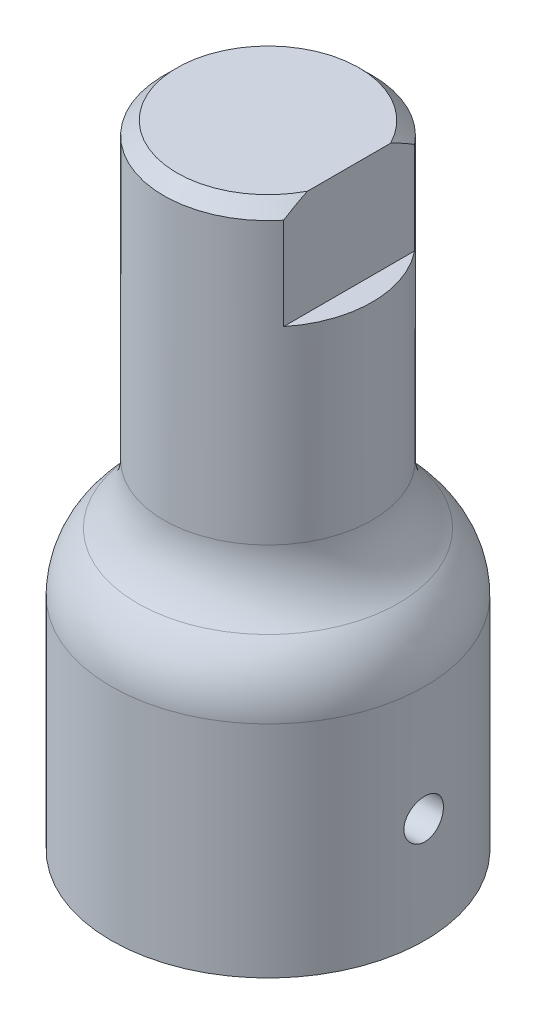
ISO-10303-21;
HEADER;
FILE_DESCRIPTION(('STEP AP214'),'2;1');
FILE_NAME('part.step','',(''),(''),'','','');
FILE_SCHEMA(('AUTOMOTIVE_DESIGN { 1 0 10303 214 1 1 1 1 }'));
ENDSEC;
DATA;
#1=APPLICATION_CONTEXT('core data for automotive mechanical design processes');
#2=APPLICATION_PROTOCOL_DEFINITION('international standard','automotive_design',2000,#1);
#3=PRODUCT_CONTEXT('',#1,'mechanical');
#4=PRODUCT('Part','Part','',(#3));
#5=PRODUCT_RELATED_PRODUCT_CATEGORY('part','',(#4));
#6=PRODUCT_DEFINITION_FORMATION('','',#4);
#7=PRODUCT_DEFINITION_CONTEXT('part definition',#1,'design');
#8=PRODUCT_DEFINITION('design','',#6,#7);
#9=PRODUCT_DEFINITION_SHAPE('','',#8);
#10=(LENGTH_UNIT() NAMED_UNIT(*) SI_UNIT(.MILLI.,.METRE.));
#11=(NAMED_UNIT(*) PLANE_ANGLE_UNIT() SI_UNIT($,.RADIAN.));
#12=(NAMED_UNIT(*) SI_UNIT($,.STERADIAN.) SOLID_ANGLE_UNIT());
#13=UNCERTAINTY_MEASURE_WITH_UNIT(LENGTH_MEASURE(1.E-05),#10,'distance_accuracy_value','');
#14=(GEOMETRIC_REPRESENTATION_CONTEXT(3) GLOBAL_UNCERTAINTY_ASSIGNED_CONTEXT((#13)) GLOBAL_UNIT_ASSIGNED_CONTEXT((#10,
#11,#12)) REPRESENTATION_CONTEXT('',''));
#15=CARTESIAN_POINT('',(0.,0.,0.));
#16=DIRECTION('',(0.,0.,1.));
#17=DIRECTION('',(1.,0.,0.));
#18=AXIS2_PLACEMENT_3D('',#15,#16,#17);
#19=CARTESIAN_POINT('',(0.,38.1,0.));
#20=DIRECTION('',(0.,-1.,0.));
#21=DIRECTION('',(0.,0.,-1.));
#22=AXIS2_PLACEMENT_3D('',#19,#20,#21);
#23=CYLINDRICAL_SURFACE('',#22,6.2865);
#24=CARTESIAN_POINT('',(0.,20.3651280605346,0.));
#25=DIRECTION('',(0.,-1.,0.));
#26=DIRECTION('',(0.,0.,-1.));
#27=AXIS2_PLACEMENT_3D('',#24,#25,#26);
#28=CIRCLE('',#27,6.2865);
#29=CARTESIAN_POINT('',(0.,20.3651280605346,-6.2865));
#30=VERTEX_POINT('',#29);
#31=EDGE_CURVE('E142',#30,#30,#28,.F.);
#32=ORIENTED_EDGE('',*,*,#31,.T.);
#33=EDGE_LOOP('',(#32));
#34=FACE_BOUND('',#33,.T.);
#35=DIRECTION('',(0.,1.,0.));
#36=VECTOR('',#35,1.);
#37=CARTESIAN_POINT('',(4.8895,31.75,3.95131269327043));
#38=LINE('',#37,#36);
#39=CARTESIAN_POINT('',(4.8895,31.75,3.95131269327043));
#40=VERTEX_POINT('',#39);
#41=CARTESIAN_POINT('',(4.8895,37.30625,3.95131269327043));
#42=VERTEX_POINT('',#41);
#43=EDGE_CURVE('E73',#40,#42,#38,.T.);
#44=ORIENTED_EDGE('',*,*,#43,.T.);
#45=CARTESIAN_POINT('',(0.,37.30625,0.));
#46=DIRECTION('',(0.,1.,0.));
#47=DIRECTION('',(0.,0.,1.));
#48=AXIS2_PLACEMENT_3D('',#45,#46,#47);
#49=CIRCLE('',#48,6.2865);
#50=CARTESIAN_POINT('',(4.8895,37.30625,-3.95131269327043));
#51=VERTEX_POINT('',#50);
#52=EDGE_CURVE('E11',#42,#51,#49,.F.);
#53=ORIENTED_EDGE('',*,*,#52,.T.);
#54=DIRECTION('',(0.,1.,0.));
#55=VECTOR('',#54,1.);
#56=CARTESIAN_POINT('',(4.8895,31.75,-3.95131269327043));
#57=LINE('',#56,#55);
#58=CARTESIAN_POINT('',(4.8895,31.75,-3.95131269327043));
#59=VERTEX_POINT('',#58);
#60=EDGE_CURVE('E71',#59,#51,#57,.T.);
#61=ORIENTED_EDGE('',*,*,#60,.F.);
#62=CARTESIAN_POINT('',(0.,31.75,0.));
#63=DIRECTION('',(0.,1.,0.));
#64=DIRECTION('',(0.,0.,1.));
#65=AXIS2_PLACEMENT_3D('',#62,#63,#64);
#66=CIRCLE('',#65,6.2865);
#67=EDGE_CURVE('E76',#40,#59,#66,.T.);
#68=ORIENTED_EDGE('',*,*,#67,.F.);
#69=EDGE_LOOP('',(#44,#53,#61,#68));
#70=FACE_BOUND('',#69,.T.);
#71=ADVANCED_FACE('F26',(#34,#70),#23,.T.);
#72=CARTESIAN_POINT('',(0.,38.1,0.));
#73=DIRECTION('',(0.,1.,0.));
#74=DIRECTION('',(0.,0.,1.));
#75=AXIS2_PLACEMENT_3D('',#72,#73,#74);
#76=PLANE('',#75);
#77=DIRECTION('',(0.,0.,-1.));
#78=VECTOR('',#77,1.);
#79=CARTESIAN_POINT('',(4.8895,38.1,3.95131269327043));
#80=LINE('',#79,#78);
#81=CARTESIAN_POINT('',(4.8895,38.1,2.50261709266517));
#82=VERTEX_POINT('',#81);
#83=CARTESIAN_POINT('',(4.8895,38.1,-2.50261709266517));
#84=VERTEX_POINT('',#83);
#85=EDGE_CURVE('E79',#82,#84,#80,.T.);
#86=ORIENTED_EDGE('',*,*,#85,.T.);
#87=CARTESIAN_POINT('',(0.,38.1,0.));
#88=DIRECTION('',(0.,1.,0.));
#89=DIRECTION('',(0.,0.,1.));
#90=AXIS2_PLACEMENT_3D('',#87,#88,#89);
#91=CIRCLE('',#90,5.49274999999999);
#92=EDGE_CURVE('E157',#84,#82,#91,.T.);
#93=ORIENTED_EDGE('',*,*,#92,.T.);
#94=EDGE_LOOP('',(#86,#93));
#95=FACE_BOUND('',#94,.T.);
#96=ADVANCED_FACE('F133',(#95),#76,.T.);
#97=CARTESIAN_POINT('',(0.,0.,0.));
#98=DIRECTION('',(0.,1.,0.));
#99=DIRECTION('',(0.,0.,1.));
#100=AXIS2_PLACEMENT_3D('',#97,#98,#99);
#101=PLANE('',#100);
#102=CARTESIAN_POINT('',(0.,0.,0.));
#103=DIRECTION('',(0.,1.,0.));
#104=DIRECTION('',(0.,0.,1.));
#105=AXIS2_PLACEMENT_3D('',#102,#103,#104);
#106=CIRCLE('',#105,9.4615);
#107=CARTESIAN_POINT('',(0.,0.,9.4615));
#108=VERTEX_POINT('',#107);
#109=EDGE_CURVE('E145',#108,#108,#106,.T.);
#110=ORIENTED_EDGE('',*,*,#109,.F.);
#111=EDGE_LOOP('',(#110));
#112=FACE_BOUND('',#111,.T.);
#113=CARTESIAN_POINT('',(0.,0.,0.));
#114=DIRECTION('',(0.,1.,0.));
#115=DIRECTION('',(0.,0.,1.));
#116=AXIS2_PLACEMENT_3D('',#113,#114,#115);
#117=CIRCLE('',#116,6.477);
#118=CARTESIAN_POINT('',(4.8895,0.,-4.24786049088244));
#119=VERTEX_POINT('',#118);
#120=CARTESIAN_POINT('',(4.8895,0.,4.24786049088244));
#121=VERTEX_POINT('',#120);
#122=EDGE_CURVE('E94',#119,#121,#117,.T.);
#123=ORIENTED_EDGE('',*,*,#122,.T.);
#124=DIRECTION('',(0.,0.,-1.));
#125=VECTOR('',#124,1.);
#126=CARTESIAN_POINT('',(4.8895,0.,4.24786049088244));
#127=LINE('',#126,#125);
#128=EDGE_CURVE('E230',#121,#119,#127,.T.);
#129=ORIENTED_EDGE('',*,*,#128,.T.);
#130=EDGE_LOOP('',(#123,#129));
#131=FACE_BOUND('',#130,.T.);
#132=ADVANCED_FACE('F130',(#112,#131),#101,.F.);
#133=CARTESIAN_POINT('',(0.,15.875,0.));
#134=DIRECTION('',(0.,-1.,0.));
#135=DIRECTION('',(0.,0.,-1.));
#136=AXIS2_PLACEMENT_3D('',#133,#134,#135);
#137=CYLINDRICAL_SURFACE('',#136,9.4615);
#138=CARTESIAN_POINT('',(9.4615,5.159375,0.));
#139=CARTESIAN_POINT('',(9.46149906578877,5.15937782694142,0.0665955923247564));
#140=CARTESIAN_POINT('',(9.46078946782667,5.16498120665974,0.133232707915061));
#141=CARTESIAN_POINT('',(9.45802699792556,5.18724558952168,0.264652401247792));
#142=CARTESIAN_POINT('',(9.4559727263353,5.20391811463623,0.329432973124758));
#143=CARTESIAN_POINT('',(9.45075231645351,5.24782157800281,0.455218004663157));
#144=CARTESIAN_POINT('',(9.44758692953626,5.27504538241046,0.516224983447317));
#145=CARTESIAN_POINT('',(9.44049627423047,5.33926296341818,0.632792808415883));
#146=CARTESIAN_POINT('',(9.43657113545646,5.37625507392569,0.688354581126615));
#147=CARTESIAN_POINT('',(9.42837468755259,5.4591797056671,0.792776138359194));
#148=CARTESIAN_POINT('',(9.42410175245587,5.50515581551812,0.841601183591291));
#149=CARTESIAN_POINT('',(9.41570439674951,5.60464976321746,0.930864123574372));
#150=CARTESIAN_POINT('',(9.41157998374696,5.65816798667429,0.97130158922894));
#151=CARTESIAN_POINT('',(9.40393064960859,5.77145295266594,1.04277106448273));
#152=CARTESIAN_POINT('',(9.40040782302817,5.83124040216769,1.07377049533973));
#153=CARTESIAN_POINT('',(9.3943819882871,5.95522437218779,1.12527587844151));
#154=CARTESIAN_POINT('',(9.39187894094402,6.01942072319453,1.14578223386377));
#155=CARTESIAN_POINT('',(9.38819160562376,6.15003951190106,1.17561373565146));
#156=CARTESIAN_POINT('',(9.38700039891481,6.21644834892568,1.18499756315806));
#157=CARTESIAN_POINT('',(9.38605044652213,6.34990810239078,1.19249922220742));
#158=CARTESIAN_POINT('',(9.3862916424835,6.41695899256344,1.19061751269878));
#159=CARTESIAN_POINT('',(9.38817291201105,6.54939039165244,1.17568967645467));
#160=CARTESIAN_POINT('',(9.3898048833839,6.61477832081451,1.16270821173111));
#161=CARTESIAN_POINT('',(9.394271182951,6.74244022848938,1.12605025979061));
#162=CARTESIAN_POINT('',(9.39710553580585,6.80471414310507,1.10237355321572));
#163=CARTESIAN_POINT('',(9.40366641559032,6.92458104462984,1.0449277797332));
#164=CARTESIAN_POINT('',(9.40739541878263,6.98216043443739,1.01113063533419));
#165=CARTESIAN_POINT('',(9.41532352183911,7.09085481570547,0.934423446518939));
#166=CARTESIAN_POINT('',(9.41952264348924,7.1419695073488,0.891512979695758));
#167=CARTESIAN_POINT('',(9.42795385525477,7.23665883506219,0.797438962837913));
#168=CARTESIAN_POINT('',(9.43218597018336,7.28017811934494,0.746219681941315));
#169=CARTESIAN_POINT('',(9.44017878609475,7.35801022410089,0.637173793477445));
#170=CARTESIAN_POINT('',(9.44393948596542,7.39232302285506,0.579347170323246));
#171=CARTESIAN_POINT('',(9.45056812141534,7.45076827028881,0.458685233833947));
#172=CARTESIAN_POINT('',(9.45343575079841,7.47489722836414,0.39584821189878));
#173=CARTESIAN_POINT('',(9.45795236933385,7.51224579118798,0.26697029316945));
#174=CARTESIAN_POINT('',(9.45960141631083,7.52546591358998,0.200929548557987));
#175=CARTESIAN_POINT('',(9.46148754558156,7.54054973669,0.0679974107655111));
#176=CARTESIAN_POINT('',(9.46173410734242,7.5424896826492,0.00111479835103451));
#177=CARTESIAN_POINT('',(9.46081308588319,7.53515933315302,-0.1320220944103));
#178=CARTESIAN_POINT('',(9.45964553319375,7.52588927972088,-0.198276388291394));
#179=CARTESIAN_POINT('',(9.45603338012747,7.49646541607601,-0.328050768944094));
#180=CARTESIAN_POINT('',(9.45359304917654,7.47634798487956,-0.391579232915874));
#181=CARTESIAN_POINT('',(9.44770853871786,7.4258382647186,-0.514360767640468));
#182=CARTESIAN_POINT('',(9.44426432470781,7.39544562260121,-0.573613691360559));
#183=CARTESIAN_POINT('',(9.43673237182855,7.32506391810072,-0.686502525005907));
#184=CARTESIAN_POINT('',(9.43264136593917,7.28502556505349,-0.740107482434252));
#185=CARTESIAN_POINT('',(9.42428361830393,7.19655867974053,-0.839863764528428));
#186=CARTESIAN_POINT('',(9.42001686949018,7.14812980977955,-0.886014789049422));
#187=CARTESIAN_POINT('',(9.41175925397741,7.04392064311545,-0.969823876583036));
#188=CARTESIAN_POINT('',(9.40777012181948,6.98809952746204,-1.00743138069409));
#189=CARTESIAN_POINT('',(9.40054799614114,6.87088838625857,-1.07273654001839));
#190=CARTESIAN_POINT('',(9.39731498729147,6.80949847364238,-1.10043439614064));
#191=CARTESIAN_POINT('',(9.39198299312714,6.6830551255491,-1.14505227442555));
#192=CARTESIAN_POINT('',(9.38988101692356,6.61801185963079,-1.1620007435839));
#193=CARTESIAN_POINT('',(9.38704051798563,6.48597437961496,-1.18473031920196));
#194=CARTESIAN_POINT('',(9.38630193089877,6.41898025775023,-1.19051195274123));
#195=CARTESIAN_POINT('',(9.3862737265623,6.28544580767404,-1.19073397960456));
#196=CARTESIAN_POINT('',(9.38697396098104,6.21890559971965,-1.18525380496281));
#197=CARTESIAN_POINT('',(9.3897226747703,6.08770006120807,-1.1632760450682));
#198=CARTESIAN_POINT('',(9.39177115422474,6.02303473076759,-1.14677845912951));
#199=CARTESIAN_POINT('',(9.39698239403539,5.89742536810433,-1.10325911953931));
#200=CARTESIAN_POINT('',(9.40014474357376,5.83647997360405,-1.07624124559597));
#201=CARTESIAN_POINT('',(9.40722807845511,5.7199750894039,-1.01245608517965));
#202=CARTESIAN_POINT('',(9.41114907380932,5.66441567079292,-0.975688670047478));
#203=CARTESIAN_POINT('',(9.41934102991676,5.55985390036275,-0.893153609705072));
#204=CARTESIAN_POINT('',(9.42361417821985,5.51089843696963,-0.847326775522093));
#205=CARTESIAN_POINT('',(9.43200968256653,5.4213420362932,-0.748097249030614));
#206=CARTESIAN_POINT('',(9.43613200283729,5.38074307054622,-0.694692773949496));
#207=CARTESIAN_POINT('',(9.44377893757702,5.30891871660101,-0.581587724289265));
#208=CARTESIAN_POINT('',(9.44730118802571,5.27773004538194,-0.521863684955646));
#209=CARTESIAN_POINT('',(9.45332718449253,5.22586939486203,-0.398014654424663));
#210=CARTESIAN_POINT('',(9.45583203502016,5.20518600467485,-0.333894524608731));
#211=CARTESIAN_POINT('',(9.45893817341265,5.1798660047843,-0.224536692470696));
#212=CARTESIAN_POINT('',(9.45989417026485,5.17219294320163,-0.179988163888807));
#213=CARTESIAN_POINT('',(9.46117539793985,5.16194650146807,-0.0902994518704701));
#214=CARTESIAN_POINT('',(9.46150063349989,5.15937308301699,-0.0451592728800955));
#215=CARTESIAN_POINT('',(9.4615,5.159375,0.));
#216=B_SPLINE_CURVE_WITH_KNOTS('',3,(#138,#139,#140,#141,#142,#143,#144,#145,#146,#147,#148,
#149,#150,#151,#152,#153,#154,#155,#156,#157,#158,#159,#160,#161,#162,#163,#164,#165,#166,#167,
#168,#169,#170,#171,#172,#173,#174,#175,#176,#177,#178,#179,#180,#181,#182,#183,#184,#185,#186,
#187,#188,#189,#190,#191,#192,#193,#194,#195,#196,#197,#198,#199,#200,#201,#202,#203,#204,#205,
#206,#207,#208,#209,#210,#211,#212,#213,#214,#215),.UNSPECIFIED.,.T.,.F.,(4,2,2,2,2,2,2,2,2,2,2,
2,2,2,2,2,2,2,2,2,2,2,2,2,2,2,2,2,2,2,2,2,2,2,2,2,2,2,4),(0.,0.19962182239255,0.399451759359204,
0.599146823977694,0.798807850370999,0.999462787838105,1.20012798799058,1.40147820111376,
1.60282067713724,1.80309609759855,2.00336335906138,2.20247184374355,2.40158441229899,
2.60125458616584,2.8009340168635,3.0020128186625,3.2030920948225,3.40424023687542,
3.60537883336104,3.80515629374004,4.00492944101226,4.20403673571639,4.40315087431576,
4.60330493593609,4.80346705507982,5.00478450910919,5.20609788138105,5.40687625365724,
5.60764514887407,5.80700283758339,6.00636053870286,6.20564478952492,6.40493167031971,
6.6055663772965,6.80624836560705,7.00770353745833,7.20893941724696,7.34430639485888,
7.47967235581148),.UNSPECIFIED.);
#217=CARTESIAN_POINT('',(9.4615,5.159375,0.));
#218=VERTEX_POINT('',#217);
#219=EDGE_CURVE('E87',#218,#218,#216,.T.);
#220=ORIENTED_EDGE('',*,*,#219,.T.);
#221=EDGE_LOOP('',(#220));
#222=FACE_BOUND('',#221,.T.);
#223=CARTESIAN_POINT('',(0.,13.2656122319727,0.));
#224=DIRECTION('',(0.,-1.,0.));
#225=DIRECTION('',(0.,0.,-1.));
#226=AXIS2_PLACEMENT_3D('',#223,#224,#225);
#227=CIRCLE('',#226,9.4615);
#228=CARTESIAN_POINT('',(0.,13.2656122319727,-9.4615));
#229=VERTEX_POINT('',#228);
#230=EDGE_CURVE('E148',#229,#229,#227,.T.);
#231=ORIENTED_EDGE('',*,*,#230,.T.);
#232=EDGE_LOOP('',(#231));
#233=FACE_BOUND('',#232,.T.);
#234=ORIENTED_EDGE('',*,*,#109,.T.);
#235=EDGE_LOOP('',(#234));
#236=FACE_BOUND('',#235,.T.);
#237=ADVANCED_FACE('F96',(#222,#233,#236),#137,.T.);
#238=CARTESIAN_POINT('',(0.,12.7,0.));
#239=DIRECTION('',(0.,-1.,0.));
#240=DIRECTION('',(0.,0.,-1.));
#241=AXIS2_PLACEMENT_3D('',#238,#239,#240);
#242=CYLINDRICAL_SURFACE('',#241,6.477);
#243=ORIENTED_EDGE('',*,*,#122,.F.);
#244=DIRECTION('',(0.,-1.,0.));
#245=VECTOR('',#244,1.);
#246=CARTESIAN_POINT('',(4.8895,12.7,-4.24786049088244));
#247=LINE('',#246,#245);
#248=CARTESIAN_POINT('',(4.8895,12.7,-4.24786049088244));
#249=VERTEX_POINT('',#248);
#250=EDGE_CURVE('E240',#249,#119,#247,.T.);
#251=ORIENTED_EDGE('',*,*,#250,.F.);
#252=CARTESIAN_POINT('',(0.,12.7,0.));
#253=DIRECTION('',(0.,1.,0.));
#254=DIRECTION('',(0.,0.,1.));
#255=AXIS2_PLACEMENT_3D('',#252,#253,#254);
#256=CIRCLE('',#255,6.477);
#257=CARTESIAN_POINT('',(4.8895,12.7,4.24786049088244));
#258=VERTEX_POINT('',#257);
#259=EDGE_CURVE('E234',#249,#258,#256,.T.);
#260=ORIENTED_EDGE('',*,*,#259,.T.);
#261=DIRECTION('',(0.,-1.,0.));
#262=VECTOR('',#261,1.);
#263=CARTESIAN_POINT('',(4.8895,12.7,4.24786049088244));
#264=LINE('',#263,#262);
#265=EDGE_CURVE('E151',#258,#121,#264,.T.);
#266=ORIENTED_EDGE('',*,*,#265,.T.);
#267=EDGE_LOOP('',(#243,#251,#260,#266));
#268=FACE_BOUND('',#267,.T.);
#269=ADVANCED_FACE('F122',(#268),#242,.F.);
#270=CARTESIAN_POINT('',(4.8895,12.7,4.24786049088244));
#271=DIRECTION('',(-1.,0.,0.));
#272=DIRECTION('',(0.,0.,1.));
#273=AXIS2_PLACEMENT_3D('',#270,#271,#272);
#274=PLANE('',#273);
#275=CARTESIAN_POINT('',(4.8895,6.35,0.));
#276=DIRECTION('',(-1.,0.,0.));
#277=DIRECTION('',(0.,0.,1.));
#278=AXIS2_PLACEMENT_3D('',#275,#276,#277);
#279=CIRCLE('',#278,1.190625);
#280=CARTESIAN_POINT('',(4.8895,6.35,1.190625));
#281=VERTEX_POINT('',#280);
#282=EDGE_CURVE('E82',#281,#281,#279,.T.);
#283=ORIENTED_EDGE('',*,*,#282,.F.);
#284=EDGE_LOOP('',(#283));
#285=FACE_BOUND('',#284,.T.);
#286=ORIENTED_EDGE('',*,*,#128,.F.);
#287=ORIENTED_EDGE('',*,*,#265,.F.);
#288=DIRECTION('',(0.,0.,-1.));
#289=VECTOR('',#288,1.);
#290=CARTESIAN_POINT('',(4.8895,12.7,4.24786049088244));
#291=LINE('',#290,#289);
#292=EDGE_CURVE('E236',#258,#249,#291,.T.);
#293=ORIENTED_EDGE('',*,*,#292,.T.);
#294=ORIENTED_EDGE('',*,*,#250,.T.);
#295=EDGE_LOOP('',(#286,#287,#293,#294));
#296=FACE_BOUND('',#295,.T.);
#297=ADVANCED_FACE('F119',(#285,#296),#274,.T.);
#298=CARTESIAN_POINT('',(0.,12.7,0.));
#299=DIRECTION('',(0.,1.,0.));
#300=DIRECTION('',(0.,0.,1.));
#301=AXIS2_PLACEMENT_3D('',#298,#299,#300);
#302=PLANE('',#301);
#303=ORIENTED_EDGE('',*,*,#259,.F.);
#304=ORIENTED_EDGE('',*,*,#292,.F.);
#305=EDGE_LOOP('',(#303,#304));
#306=FACE_BOUND('',#305,.T.);
#307=ADVANCED_FACE('F115',(#306),#302,.F.);
#308=CARTESIAN_POINT('',(0.,20.3651280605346,0.));
#309=DIRECTION('',(0.,-1.,0.));
#310=DIRECTION('',(0.,0.,-1.));
#311=AXIS2_PLACEMENT_3D('',#308,#309,#310);
#312=TOROIDAL_SURFACE('',#311,11.049,4.7625);
#313=CARTESIAN_POINT('',(0.,16.8153701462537,0.));
#314=DIRECTION('',(0.,1.,0.));
#315=DIRECTION('',(0.,0.,1.));
#316=AXIS2_PLACEMENT_3D('',#313,#314,#315);
#317=CIRCLE('',#316,7.874);
#318=CARTESIAN_POINT('',(0.,16.8153701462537,7.874));
#319=VERTEX_POINT('',#318);
#320=EDGE_CURVE('E144',#319,#319,#317,.T.);
#321=ORIENTED_EDGE('',*,*,#320,.T.);
#322=EDGE_LOOP('',(#321));
#323=FACE_BOUND('',#322,.T.);
#324=ORIENTED_EDGE('',*,*,#31,.F.);
#325=EDGE_LOOP('',(#324));
#326=FACE_BOUND('',#325,.T.);
#327=ADVANCED_FACE('F111',(#323,#326),#312,.F.);
#328=CARTESIAN_POINT('',(0.,13.2656122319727,0.));
#329=DIRECTION('',(0.,-1.,0.));
#330=DIRECTION('',(0.,0.,-1.));
#331=AXIS2_PLACEMENT_3D('',#328,#329,#330);
#332=DEGENERATE_TOROIDAL_SURFACE('',#331,4.699,4.7625,.T.);
#333=ORIENTED_EDGE('',*,*,#230,.F.);
#334=EDGE_LOOP('',(#333));
#335=FACE_BOUND('',#334,.T.);
#336=ORIENTED_EDGE('',*,*,#320,.F.);
#337=EDGE_LOOP('',(#336));
#338=FACE_BOUND('',#337,.T.);
#339=ADVANCED_FACE('F105',(#335,#338),#332,.T.);
#340=CARTESIAN_POINT('',(9.4615,6.35,0.));
#341=DIRECTION('',(-1.,0.,0.));
#342=DIRECTION('',(0.,0.,1.));
#343=AXIS2_PLACEMENT_3D('',#340,#341,#342);
#344=CYLINDRICAL_SURFACE('',#343,1.190625);
#345=ORIENTED_EDGE('',*,*,#282,.T.);
#346=EDGE_LOOP('',(#345));
#347=FACE_BOUND('',#346,.T.);
#348=ORIENTED_EDGE('',*,*,#219,.F.);
#349=EDGE_LOOP('',(#348));
#350=FACE_BOUND('',#349,.T.);
#351=ADVANCED_FACE('F100',(#347,#350),#344,.F.);
#352=CARTESIAN_POINT('',(4.8895,31.75,3.95131269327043));
#353=DIRECTION('',(1.,0.,0.));
#354=DIRECTION('',(0.,0.,-1.));
#355=AXIS2_PLACEMENT_3D('',#352,#353,#354);
#356=PLANE('',#355);
#357=ORIENTED_EDGE('',*,*,#85,.F.);
#358=CARTESIAN_POINT('',(4.8895,38.1,2.50261709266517));
#359=CARTESIAN_POINT('',(4.8895,38.0428169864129,2.62807233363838));
#360=CARTESIAN_POINT('',(4.8895,37.9828658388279,2.75222812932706));
#361=CARTESIAN_POINT('',(4.8895,37.8582936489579,2.9980084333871));
#362=CARTESIAN_POINT('',(4.8895,37.7936778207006,3.11963557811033));
#363=CARTESIAN_POINT('',(4.8895,37.6605287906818,3.36067333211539));
#364=CARTESIAN_POINT('',(4.8895,37.5919965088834,3.48008445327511));
#365=CARTESIAN_POINT('',(4.8895,37.451519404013,3.7170633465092));
#366=CARTESIAN_POINT('',(4.8895,37.3795709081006,3.83462894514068));
#367=CARTESIAN_POINT('',(4.8895,37.30625,3.95131269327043));
#368=B_SPLINE_CURVE_WITH_KNOTS('',3,(#358,#359,#360,#361,#362,#363,#364,#365,#366,#367),
.UNSPECIFIED.,.F.,.F.,(4,2,2,2,4),(0.,0.413535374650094,0.826615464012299,1.23959891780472,
1.6530369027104),.UNSPECIFIED.);
#369=EDGE_CURVE('E33',#82,#42,#368,.T.);
#370=ORIENTED_EDGE('',*,*,#369,.T.);
#371=ORIENTED_EDGE('',*,*,#43,.F.);
#372=DIRECTION('',(0.,0.,-1.));
#373=VECTOR('',#372,1.);
#374=CARTESIAN_POINT('',(4.8895,31.75,3.95131269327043));
#375=LINE('',#374,#373);
#376=EDGE_CURVE('E68',#40,#59,#375,.T.);
#377=ORIENTED_EDGE('',*,*,#376,.T.);
#378=ORIENTED_EDGE('',*,*,#60,.T.);
#379=CARTESIAN_POINT('',(4.8895,37.30625,-3.95131269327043));
#380=CARTESIAN_POINT('',(4.8895,37.3795709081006,-3.83462894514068));
#381=CARTESIAN_POINT('',(4.8895,37.451519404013,-3.7170633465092));
#382=CARTESIAN_POINT('',(4.8895,37.5919965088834,-3.48008445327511));
#383=CARTESIAN_POINT('',(4.8895,37.6605287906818,-3.36067333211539));
#384=CARTESIAN_POINT('',(4.8895,37.7936778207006,-3.11963557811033));
#385=CARTESIAN_POINT('',(4.8895,37.8582936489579,-2.9980084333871));
#386=CARTESIAN_POINT('',(4.8895,37.9828658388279,-2.75222812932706));
#387=CARTESIAN_POINT('',(4.8895,38.0428169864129,-2.62807233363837));
#388=CARTESIAN_POINT('',(4.8895,38.1,-2.50261709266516));
#389=B_SPLINE_CURVE_WITH_KNOTS('',3,(#379,#380,#381,#382,#383,#384,#385,#386,#387,#388),
.UNSPECIFIED.,.F.,.F.,(4,2,2,2,4),(0.,0.41343798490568,0.826421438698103,1.23950152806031,
1.6530369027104),.UNSPECIFIED.);
#390=EDGE_CURVE('E160',#51,#84,#389,.T.);
#391=ORIENTED_EDGE('',*,*,#390,.T.);
#392=EDGE_LOOP('',(#357,#370,#371,#377,#378,#391));
#393=FACE_BOUND('',#392,.T.);
#394=ADVANCED_FACE('F70',(#393),#356,.T.);
#395=CARTESIAN_POINT('',(0.,31.75,0.));
#396=DIRECTION('',(0.,1.,0.));
#397=DIRECTION('',(0.,0.,1.));
#398=AXIS2_PLACEMENT_3D('',#395,#396,#397);
#399=PLANE('',#398);
#400=ORIENTED_EDGE('',*,*,#67,.T.);
#401=ORIENTED_EDGE('',*,*,#376,.F.);
#402=EDGE_LOOP('',(#400,#401));
#403=FACE_BOUND('',#402,.T.);
#404=ADVANCED_FACE('F78',(#403),#399,.T.);
#405=CARTESIAN_POINT('',(0.,38.1,0.));
#406=DIRECTION('',(0.,-1.,0.));
#407=DIRECTION('',(0.,0.,-1.));
#408=AXIS2_PLACEMENT_3D('',#405,#406,#407);
#409=CONICAL_SURFACE('',#408,5.49274999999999,0.785398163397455);
#410=ORIENTED_EDGE('',*,*,#390,.F.);
#411=ORIENTED_EDGE('',*,*,#52,.F.);
#412=ORIENTED_EDGE('',*,*,#369,.F.);
#413=ORIENTED_EDGE('',*,*,#92,.F.);
#414=EDGE_LOOP('',(#410,#411,#412,#413));
#415=FACE_BOUND('',#414,.T.);
#416=ADVANCED_FACE('F168',(#415),#409,.T.);
#417=CLOSED_SHELL('',(#71,#96,#132,#237,#269,#297,#307,#327,#339,#351,#394,#404,#416));
#418=MANIFOLD_SOLID_BREP('B2',#417);
#419=ADVANCED_BREP_SHAPE_REPRESENTATION('',(#18,#418),#14);
#420=SHAPE_DEFINITION_REPRESENTATION(#9,#419);
ENDSEC;
END-ISO-10303-21;
